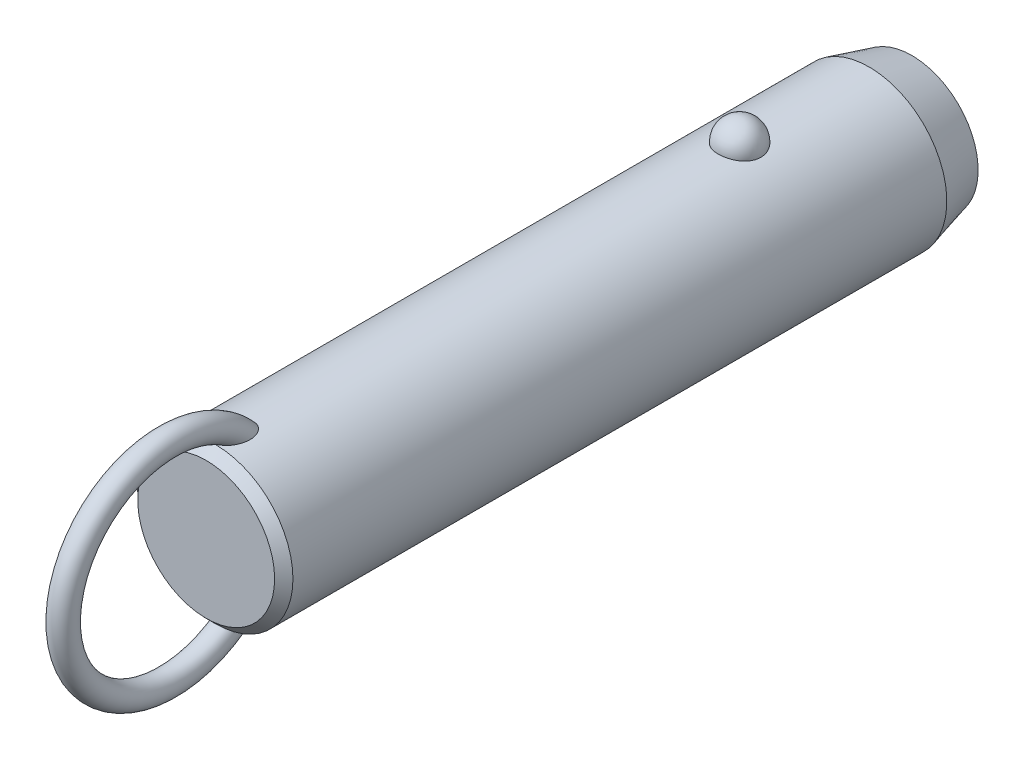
ISO-10303-21;
HEADER;
FILE_DESCRIPTION(('STEP AP214'),'2;1');
FILE_NAME('part.step','',(''),(''),'','','');
FILE_SCHEMA(('AUTOMOTIVE_DESIGN { 1 0 10303 214 1 1 1 1 }'));
ENDSEC;
DATA;
#1=APPLICATION_CONTEXT('core data for automotive mechanical design processes');
#2=APPLICATION_PROTOCOL_DEFINITION('international standard','automotive_design',2000,#1);
#3=PRODUCT_CONTEXT('',#1,'mechanical');
#4=PRODUCT('Part','Part','',(#3));
#5=PRODUCT_RELATED_PRODUCT_CATEGORY('part','',(#4));
#6=PRODUCT_DEFINITION_FORMATION('','',#4);
#7=PRODUCT_DEFINITION_CONTEXT('part definition',#1,'design');
#8=PRODUCT_DEFINITION('design','',#6,#7);
#9=PRODUCT_DEFINITION_SHAPE('','',#8);
#10=(LENGTH_UNIT() NAMED_UNIT(*) SI_UNIT(.MILLI.,.METRE.));
#11=(NAMED_UNIT(*) PLANE_ANGLE_UNIT() SI_UNIT($,.RADIAN.));
#12=(NAMED_UNIT(*) SI_UNIT($,.STERADIAN.) SOLID_ANGLE_UNIT());
#13=UNCERTAINTY_MEASURE_WITH_UNIT(LENGTH_MEASURE(1.E-05),#10,'distance_accuracy_value','');
#14=(GEOMETRIC_REPRESENTATION_CONTEXT(3) GLOBAL_UNCERTAINTY_ASSIGNED_CONTEXT((#13)) GLOBAL_UNIT_ASSIGNED_CONTEXT((#10,
#11,#12)) REPRESENTATION_CONTEXT('',''));
#15=CARTESIAN_POINT('',(0.,0.,0.));
#16=DIRECTION('',(0.,0.,1.));
#17=DIRECTION('',(1.,0.,0.));
#18=AXIS2_PLACEMENT_3D('',#15,#16,#17);
#19=CARTESIAN_POINT('',(0.,0.,71.1));
#20=DIRECTION('',(0.,0.,-1.));
#21=DIRECTION('',(-1.,0.,0.));
#22=AXIS2_PLACEMENT_3D('',#19,#20,#21);
#23=CYLINDRICAL_SURFACE('',#22,12.7);
#24=CARTESIAN_POINT('',(3.46661256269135,12.2177165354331,-3.5));
#25=CARTESIAN_POINT('',(3.4666090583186,12.2177194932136,-3.30432790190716));
#26=CARTESIAN_POINT('',(3.45063567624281,12.2222841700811,-3.10861112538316));
#27=CARTESIAN_POINT('',(3.38712451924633,12.2400345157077,-2.72271899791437));
#28=CARTESIAN_POINT('',(3.33957415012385,12.2532236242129,-2.53254588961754));
#29=CARTESIAN_POINT('',(3.2141234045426,12.286724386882,-2.16324948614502));
#30=CARTESIAN_POINT('',(3.13623639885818,12.3070329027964,-1.98412136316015));
#31=CARTESIAN_POINT('',(2.95205930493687,12.3525018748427,-1.64180592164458));
#32=CARTESIAN_POINT('',(2.84577003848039,12.3776621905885,-1.47861814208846));
#33=CARTESIAN_POINT('',(2.60688050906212,12.4301712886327,-1.17190583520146));
#34=CARTESIAN_POINT('',(2.47415697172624,12.4575299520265,-1.02847897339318));
#35=CARTESIAN_POINT('',(2.18615174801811,12.5112810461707,-0.766177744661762));
#36=CARTESIAN_POINT('',(2.03087002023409,12.5376734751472,-0.64730342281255));
#37=CARTESIAN_POINT('',(1.70237334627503,12.5864761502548,-0.437732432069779));
#38=CARTESIAN_POINT('',(1.52920948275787,12.6088972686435,-0.346958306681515));
#39=CARTESIAN_POINT('',(1.16944170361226,12.6473352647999,-0.195750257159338));
#40=CARTESIAN_POINT('',(0.982839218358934,12.663352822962,-0.135313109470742));
#41=CARTESIAN_POINT('',(0.604961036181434,12.6869706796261,-0.0473241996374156));
#42=CARTESIAN_POINT('',(0.41382314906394,12.6947125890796,-0.0192185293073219));
#43=CARTESIAN_POINT('',(0.0293827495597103,12.7014203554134,0.0051725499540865));
#44=CARTESIAN_POINT('',(-0.163919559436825,12.7003870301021,0.00146092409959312));
#45=CARTESIAN_POINT('',(-0.544374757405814,12.689735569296,-0.0373939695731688));
#46=CARTESIAN_POINT('',(-0.731575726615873,12.6802364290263,-0.0721015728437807));
#47=CARTESIAN_POINT('',(-1.09733277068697,12.6538333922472,-0.171364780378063));
#48=CARTESIAN_POINT('',(-1.27588869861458,12.6369293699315,-0.235920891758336));
#49=CARTESIAN_POINT('',(-1.6204698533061,12.5973946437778,-0.393548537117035));
#50=CARTESIAN_POINT('',(-1.78641865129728,12.5747321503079,-0.486778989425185));
#51=CARTESIAN_POINT('',(-2.10030671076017,12.5261316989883,-0.699110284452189));
#52=CARTESIAN_POINT('',(-2.24824419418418,12.5001934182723,-0.818213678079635));
#53=CARTESIAN_POINT('',(-2.52491489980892,12.4472906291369,-1.08157124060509));
#54=CARTESIAN_POINT('',(-2.65324222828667,12.4203160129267,-1.22624992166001));
#55=CARTESIAN_POINT('',(-2.88410007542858,12.3687509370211,-1.53528325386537));
#56=CARTESIAN_POINT('',(-2.98662883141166,12.3441606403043,-1.69963924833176));
#57=CARTESIAN_POINT('',(-3.16432417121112,12.2998199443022,-2.04548497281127));
#58=CARTESIAN_POINT('',(-3.23917525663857,12.2801261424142,-2.22714424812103));
#59=CARTESIAN_POINT('',(-3.35800573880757,12.248167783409,-2.6009138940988));
#60=CARTESIAN_POINT('',(-3.4019860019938,12.2359030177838,-2.79302397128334));
#61=CARTESIAN_POINT('',(-3.45784812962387,12.2202347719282,-3.18140279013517));
#62=CARTESIAN_POINT('',(-3.46986123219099,12.2167950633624,-3.37765118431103));
#63=CARTESIAN_POINT('',(-3.46186273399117,12.2190638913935,-3.76943689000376));
#64=CARTESIAN_POINT('',(-3.44185196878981,12.2247721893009,-3.96497421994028));
#65=CARTESIAN_POINT('',(-3.37048652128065,12.2446381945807,-4.34881728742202));
#66=CARTESIAN_POINT('',(-3.31928253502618,12.2587552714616,-4.53715319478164));
#67=CARTESIAN_POINT('',(-3.18693461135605,12.2938237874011,-4.90231727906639));
#68=CARTESIAN_POINT('',(-3.1057895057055,12.3147754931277,-5.07914500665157));
#69=CARTESIAN_POINT('',(-2.91506431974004,12.3613125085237,-5.41732059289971));
#70=CARTESIAN_POINT('',(-2.80533587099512,12.3869217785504,-5.57858147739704));
#71=CARTESIAN_POINT('',(-2.560414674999,12.4398525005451,-5.88013283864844));
#72=CARTESIAN_POINT('',(-2.42522099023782,12.4671740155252,-6.02042254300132));
#73=CARTESIAN_POINT('',(-2.1323357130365,12.5205965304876,-6.27662798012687));
#74=CARTESIAN_POINT('',(-1.97456596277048,12.5466928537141,-6.3924554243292));
#75=CARTESIAN_POINT('',(-1.64115839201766,12.5946384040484,-6.59583547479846));
#76=CARTESIAN_POINT('',(-1.46552179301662,12.6164879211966,-6.68339001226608));
#77=CARTESIAN_POINT('',(-1.10356050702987,12.6532533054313,-6.82682153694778));
#78=CARTESIAN_POINT('',(-0.9173913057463,12.6682500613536,-6.8830698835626));
#79=CARTESIAN_POINT('',(-0.537836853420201,12.6900288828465,-6.96386887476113));
#80=CARTESIAN_POINT('',(-0.344452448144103,12.6968119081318,-6.9884232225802));
#81=CARTESIAN_POINT('',(0.0402577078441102,12.7013667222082,-7.00496469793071));
#82=CARTESIAN_POINT('',(0.231556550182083,12.6993008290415,-6.99753844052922));
#83=CARTESIAN_POINT('',(0.610105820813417,12.6867505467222,-6.9516636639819));
#84=CARTESIAN_POINT('',(0.797356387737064,12.6762664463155,-6.913216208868));
#85=CARTESIAN_POINT('',(1.16186657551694,12.6480587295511,-6.80658431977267));
#86=CARTESIAN_POINT('',(1.33915951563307,12.6303611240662,-6.73850666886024));
#87=CARTESIAN_POINT('',(1.67968518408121,12.5896027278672,-6.5745087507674));
#88=CARTESIAN_POINT('',(1.84291705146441,12.5665416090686,-6.47858678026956));
#89=CARTESIAN_POINT('',(2.15340192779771,12.5171072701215,-6.25982455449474));
#90=CARTESIAN_POINT('',(2.30037831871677,12.4906895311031,-6.13660186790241));
#91=CARTESIAN_POINT('',(2.5717412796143,12.4376567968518,-5.86739587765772));
#92=CARTESIAN_POINT('',(2.69612388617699,12.4110417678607,-5.72140858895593));
#93=CARTESIAN_POINT('',(2.92107785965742,12.360051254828,-5.40794137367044));
#94=CARTESIAN_POINT('',(3.02121329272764,12.3357209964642,-5.24014110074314));
#95=CARTESIAN_POINT('',(3.19236291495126,12.2925446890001,-4.88969865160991));
#96=CARTESIAN_POINT('',(3.26338839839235,12.2736965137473,-4.70706226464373));
#97=CARTESIAN_POINT('',(3.36788038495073,12.245404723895,-4.35469510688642));
#98=CARTESIAN_POINT('',(3.40484026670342,12.2351018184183,-4.18605935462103));
#99=CARTESIAN_POINT('',(3.45420764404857,12.2212564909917,-3.84496058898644));
#100=CARTESIAN_POINT('',(3.46661565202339,12.2177139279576,-3.67249765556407));
#101=CARTESIAN_POINT('',(3.46661256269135,12.2177165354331,-3.5));
#102=B_SPLINE_CURVE_WITH_KNOTS('',3,(#24,#25,#26,#27,#28,#29,#30,#31,#32,#33,#34,#35,#36,#37,
#38,#39,#40,#41,#42,#43,#44,#45,#46,#47,#48,#49,#50,#51,#52,#53,#54,#55,#56,#57,#58,#59,#60,#61,
#62,#63,#64,#65,#66,#67,#68,#69,#70,#71,#72,#73,#74,#75,#76,#77,#78,#79,#80,#81,#82,#83,#84,#85,
#86,#87,#88,#89,#90,#91,#92,#93,#94,#95,#96,#97,#98,#99,#100,#101),.UNSPECIFIED.,.T.,.F.,(4,2,2,
2,2,2,2,2,2,2,2,2,2,2,2,2,2,2,2,2,2,2,2,2,2,2,2,2,2,2,2,2,2,2,2,2,2,2,4),(0.,0.586396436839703,
1.17302689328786,1.7593990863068,2.34575431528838,2.93491084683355,3.52406845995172,
4.11158733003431,4.69904375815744,5.2762784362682,5.85345931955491,6.42265312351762,
6.99185659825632,7.56427334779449,8.136746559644,8.71981013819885,9.3029135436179,
9.89247258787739,10.4820150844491,11.0691335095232,11.6562366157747,12.2405256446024,
12.8248374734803,13.412244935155,13.9996740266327,14.5891883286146,15.1786623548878,
15.7609861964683,16.3432419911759,16.9148635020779,17.4864654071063,18.0560241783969,
18.6256177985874,19.2037609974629,19.7820055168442,20.3699810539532,20.957728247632,
21.4746855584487,21.9916320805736),.UNSPECIFIED.);
#103=CARTESIAN_POINT('',(3.46661256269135,12.2177165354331,-3.5));
#104=VERTEX_POINT('',#103);
#105=EDGE_CURVE('E41',#104,#104,#102,.T.);
#106=ORIENTED_EDGE('',*,*,#105,.T.);
#107=EDGE_LOOP('',(#106));
#108=FACE_BOUND('',#107,.T.);
#109=CARTESIAN_POINT('',(0.,0.,82.3));
#110=DIRECTION('',(0.,0.,1.));
#111=DIRECTION('',(1.,0.,0.));
#112=AXIS2_PLACEMENT_3D('',#109,#110,#111);
#113=CIRCLE('',#112,12.7);
#114=CARTESIAN_POINT('',(12.7,0.,82.3));
#115=VERTEX_POINT('',#114);
#116=EDGE_CURVE('E10',#115,#115,#113,.F.);
#117=ORIENTED_EDGE('',*,*,#116,.T.);
#118=EDGE_LOOP('',(#117));
#119=FACE_BOUND('',#118,.T.);
#120=CARTESIAN_POINT('',(-0.548122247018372,-12.6881662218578,76.0432187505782));
#121=CARTESIAN_POINT('',(-0.648865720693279,-12.6838128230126,76.077926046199));
#122=CARTESIAN_POINT('',(-0.746398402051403,-12.6783867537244,76.1220428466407));
#123=CARTESIAN_POINT('',(-0.93212506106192,-12.666091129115,76.2267647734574));
#124=CARTESIAN_POINT('',(-1.02030388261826,-12.6592192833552,76.287396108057));
#125=CARTESIAN_POINT('',(-1.18487740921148,-12.6448747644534,76.421847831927));
#126=CARTESIAN_POINT('',(-1.26134296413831,-12.637406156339,76.4955825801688));
#127=CARTESIAN_POINT('',(-1.4023120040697,-12.6225412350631,76.6536045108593));
#128=CARTESIAN_POINT('',(-1.46681470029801,-12.6151449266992,76.7378923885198));
#129=CARTESIAN_POINT('',(-1.60714786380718,-12.5981718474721,76.9496577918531));
#130=CARTESIAN_POINT('',(-1.67725126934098,-12.588900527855,77.0809624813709));
#131=CARTESIAN_POINT('',(-1.79536591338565,-12.5725964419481,77.3532471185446));
#132=CARTESIAN_POINT('',(-1.84333535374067,-12.5655679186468,77.4942447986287));
#133=CARTESIAN_POINT('',(-1.93422576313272,-12.5519624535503,77.8376455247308));
#134=CARTESIAN_POINT('',(-1.96788773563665,-12.5466298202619,78.0425578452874));
#135=CARTESIAN_POINT('',(-1.9941399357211,-12.542463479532,78.3517600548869));
#136=CARTESIAN_POINT('',(-1.99883864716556,-12.5417153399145,78.4552987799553));
#137=CARTESIAN_POINT('',(-2.00078003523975,-12.5414074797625,78.6624512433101));
#138=CARTESIAN_POINT('',(-1.99802449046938,-12.5418474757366,78.7660649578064));
#139=CARTESIAN_POINT('',(-1.98336733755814,-12.5441750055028,79.0103207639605));
#140=CARTESIAN_POINT('',(-1.96851430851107,-12.5465291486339,79.1507804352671));
#141=CARTESIAN_POINT('',(-1.92707089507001,-12.5529612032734,79.4299607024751));
#142=CARTESIAN_POINT('',(-1.90047458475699,-12.5570399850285,79.5686803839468));
#143=CARTESIAN_POINT('',(-1.83619120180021,-12.5666008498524,79.8434113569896));
#144=CARTESIAN_POINT('',(-1.79850828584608,-12.57208240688,79.9794236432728));
#145=CARTESIAN_POINT('',(-1.71223796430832,-12.5841228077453,80.2478421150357));
#146=CARTESIAN_POINT('',(-1.66365679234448,-12.5906810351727,80.3802503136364));
#147=CARTESIAN_POINT('',(-1.5780450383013,-12.6016176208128,80.5854887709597));
#148=CARTESIAN_POINT('',(-1.54477252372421,-12.6057501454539,80.6599149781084));
#149=CARTESIAN_POINT('',(-1.47424480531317,-12.6141930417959,80.8068393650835));
#150=CARTESIAN_POINT('',(-1.43699041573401,-12.6185033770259,80.8793379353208));
#151=CARTESIAN_POINT('',(-1.35825795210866,-12.6272207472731,81.0218926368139));
#152=CARTESIAN_POINT('',(-1.31678520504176,-12.6316276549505,81.0919517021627));
#153=CARTESIAN_POINT('',(-1.22917793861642,-12.6404532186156,81.2290705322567));
#154=CARTESIAN_POINT('',(-1.18304514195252,-12.6448718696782,81.2961313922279));
#155=CARTESIAN_POINT('',(-1.07246411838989,-12.6547893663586,81.4438741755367));
#156=CARTESIAN_POINT('',(-1.00642239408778,-12.6602600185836,81.5233844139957));
#157=CARTESIAN_POINT('',(-0.864441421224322,-12.6707460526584,81.6731698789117));
#158=CARTESIAN_POINT('',(-0.788516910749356,-12.6757620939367,81.7434585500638));
#159=CARTESIAN_POINT('',(-0.652215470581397,-12.6833591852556,81.8486801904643));
#160=CARTESIAN_POINT('',(-0.594982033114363,-12.6861973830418,81.8876241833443));
#161=CARTESIAN_POINT('',(-0.475269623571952,-12.6912445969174,81.9564899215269));
#162=CARTESIAN_POINT('',(-0.412800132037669,-12.6934547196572,81.9864275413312));
#163=CARTESIAN_POINT('',(-0.295749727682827,-12.6966636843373,82.0297565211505));
#164=CARTESIAN_POINT('',(-0.241949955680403,-12.6978134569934,82.0452188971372));
#165=CARTESIAN_POINT('',(-0.132508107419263,-12.6994261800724,82.0668845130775));
#166=CARTESIAN_POINT('',(-0.0768679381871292,-12.6998898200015,82.0730970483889));
#167=CARTESIAN_POINT('',(0.0347696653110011,-12.7000752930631,82.0755838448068));
#168=CARTESIAN_POINT('',(0.0907676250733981,-12.6997954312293,82.0718353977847));
#169=CARTESIAN_POINT('',(0.201283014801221,-12.6985255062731,82.0547883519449));
#170=CARTESIAN_POINT('',(0.255799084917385,-12.6975348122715,82.0414812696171));
#171=CARTESIAN_POINT('',(0.376042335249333,-12.6946091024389,82.0020379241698));
#172=CARTESIAN_POINT('',(0.44095085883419,-12.6924943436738,81.9734492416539));
#173=CARTESIAN_POINT('',(0.565350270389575,-12.6875639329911,81.9063234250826));
#174=CARTESIAN_POINT('',(0.624828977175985,-12.6847467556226,81.8677646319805));
#175=CARTESIAN_POINT('',(0.774116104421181,-12.6767252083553,81.756949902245));
#176=CARTESIAN_POINT('',(0.859449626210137,-12.6711344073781,81.6787605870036));
#177=CARTESIAN_POINT('',(1.01789440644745,-12.6593922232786,81.510943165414));
#178=CARTESIAN_POINT('',(1.09096902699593,-12.653239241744,81.421282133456));
#179=CARTESIAN_POINT('',(1.22268793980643,-12.6411674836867,81.2402658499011));
#180=CARTESIAN_POINT('',(1.28193986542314,-12.6352572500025,81.149345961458));
#181=CARTESIAN_POINT('',(1.39259777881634,-12.6235401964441,80.9627929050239));
#182=CARTESIAN_POINT('',(1.44399707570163,-12.6177334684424,80.8671558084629));
#183=CARTESIAN_POINT('',(1.53972870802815,-12.6064093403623,80.6722738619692));
#184=CARTESIAN_POINT('',(1.58405262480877,-12.6008922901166,80.5730248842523));
#185=CARTESIAN_POINT('',(1.66600705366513,-12.5903187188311,80.3717727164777));
#186=CARTESIAN_POINT('',(1.70363651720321,-12.5852622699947,80.2697690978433));
#187=CARTESIAN_POINT('',(1.77545379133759,-12.5753406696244,80.0543580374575));
#188=CARTESIAN_POINT('',(1.80903453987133,-12.5705328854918,79.940745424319));
#189=CARTESIAN_POINT('',(1.86844163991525,-12.5618400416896,79.7114575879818));
#190=CARTESIAN_POINT('',(1.89426665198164,-12.5579551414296,79.5957820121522));
#191=CARTESIAN_POINT('',(1.9378546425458,-12.5513030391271,79.3630072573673));
#192=CARTESIAN_POINT('',(1.9556264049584,-12.5485346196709,79.2459097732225));
#193=CARTESIAN_POINT('',(1.98264463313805,-12.5442934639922,79.0107473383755));
#194=CARTESIAN_POINT('',(1.99189298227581,-12.5428204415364,78.8926826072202));
#195=CARTESIAN_POINT('',(2.00416068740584,-12.540871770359,78.5806225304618));
#196=CARTESIAN_POINT('',(1.99944433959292,-12.541631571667,78.3862290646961));
#197=CARTESIAN_POINT('',(1.96113755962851,-12.5476846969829,78.0003095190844));
#198=CARTESIAN_POINT('',(1.92758341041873,-12.5529723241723,77.8087801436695));
#199=CARTESIAN_POINT('',(1.83934342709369,-12.5661532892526,77.4822728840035));
#200=CARTESIAN_POINT('',(1.79215440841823,-12.5730485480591,77.3452499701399));
#201=CARTESIAN_POINT('',(1.67676242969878,-12.588958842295,77.0804459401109));
#202=CARTESIAN_POINT('',(1.60859050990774,-12.597970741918,76.9526515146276));
#203=CARTESIAN_POINT('',(1.46583832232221,-12.6152829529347,76.7358006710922));
#204=CARTESIAN_POINT('',(1.39525727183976,-12.6233659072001,76.6441050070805));
#205=CARTESIAN_POINT('',(1.23992594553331,-12.6395676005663,76.4734854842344));
#206=CARTESIAN_POINT('',(1.1551793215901,-12.6476863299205,76.3945583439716));
#207=CARTESIAN_POINT('',(0.971995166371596,-12.6630846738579,76.2526438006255));
#208=CARTESIAN_POINT('',(0.873456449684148,-12.6703572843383,76.1897849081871));
#209=CARTESIAN_POINT('',(0.665847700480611,-12.6829569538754,76.0844870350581));
#210=CARTESIAN_POINT('',(0.556784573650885,-12.688285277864,76.0420347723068));
#211=CARTESIAN_POINT('',(0.347338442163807,-12.6956226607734,75.9844434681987));
#212=CARTESIAN_POINT('',(0.247759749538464,-12.6979816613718,75.9663996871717));
#213=CARTESIAN_POINT('',(0.0470218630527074,-12.7003077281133,75.948600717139));
#214=CARTESIAN_POINT('',(-0.0541350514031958,-12.7002779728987,75.9488212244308));
#215=CARTESIAN_POINT('',(-0.221414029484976,-12.6982482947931,75.9643639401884));
#216=CARTESIAN_POINT('',(-0.288055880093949,-12.6969033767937,75.9746662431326));
#217=CARTESIAN_POINT('',(-0.419599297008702,-12.6932369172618,76.0031348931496));
#218=CARTESIAN_POINT('',(-0.484501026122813,-12.6909154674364,76.0213005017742));
#219=CARTESIAN_POINT('',(-0.548122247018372,-12.6881662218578,76.0432187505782));
#220=B_SPLINE_CURVE_WITH_KNOTS('',3,(#120,#121,#122,#123,#124,#125,#126,#127,#128,#129,#130,
#131,#132,#133,#134,#135,#136,#137,#138,#139,#140,#141,#142,#143,#144,#145,#146,#147,#148,#149,
#150,#151,#152,#153,#154,#155,#156,#157,#158,#159,#160,#161,#162,#163,#164,#165,#166,#167,#168,
#169,#170,#171,#172,#173,#174,#175,#176,#177,#178,#179,#180,#181,#182,#183,#184,#185,#186,#187,
#188,#189,#190,#191,#192,#193,#194,#195,#196,#197,#198,#199,#200,#201,#202,#203,#204,#205,#206,
#207,#208,#209,#210,#211,#212,#213,#214,#215,#216,#217,#218,#219),.UNSPECIFIED.,.T.,.F.,(4,2,2,
2,2,2,2,2,2,2,2,2,2,2,2,2,2,2,2,2,2,2,2,2,2,2,2,2,2,2,2,2,2,2,2,2,2,2,2,2,2,2,2,2,2,2,2,2,2,4),
(0.,0.31964225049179,0.639794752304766,0.957927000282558,1.27608021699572,1.72100165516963,
2.16675988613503,2.78630021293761,3.0970578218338,3.40774128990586,3.83096358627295,
4.2543996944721,4.67767724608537,5.10071330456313,5.34550297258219,5.59024267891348,
5.83467707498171,6.07902143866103,6.38891080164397,6.69834321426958,6.90560910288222,
7.11250749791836,7.27977315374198,7.44687060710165,7.61434932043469,7.78197685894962,
7.99365544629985,8.20579780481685,8.55147335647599,8.89816429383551,9.22375138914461,
9.5496143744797,9.87586224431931,10.202161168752,10.557587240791,10.9130746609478,
11.2681734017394,11.6231936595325,12.2046601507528,12.7853961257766,13.219164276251,
13.6522938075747,13.9989174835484,14.3454519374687,14.6946768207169,15.0436740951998,
15.3457513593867,15.6474266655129,15.8493051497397,16.0511646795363),.UNSPECIFIED.);
#221=CARTESIAN_POINT('',(-0.548122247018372,-12.6881662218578,76.0432187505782));
#222=VERTEX_POINT('',#221);
#223=EDGE_CURVE('E59',#222,#222,#220,.T.);
#224=ORIENTED_EDGE('',*,*,#223,.T.);
#225=EDGE_LOOP('',(#224));
#226=FACE_BOUND('',#225,.T.);
#227=CARTESIAN_POINT('',(-0.548122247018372,12.6881662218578,76.0432187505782));
#228=CARTESIAN_POINT('',(-0.459436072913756,12.6919968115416,76.012673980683));
#229=CARTESIAN_POINT('',(-0.368189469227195,12.6949996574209,75.9893913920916));
#230=CARTESIAN_POINT('',(-0.183024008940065,12.6990186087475,75.9584062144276));
#231=CARTESIAN_POINT('',(-0.0891049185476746,12.7000345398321,75.9507049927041));
#232=CARTESIAN_POINT('',(0.0987147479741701,12.6999636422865,75.9512455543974));
#233=CARTESIAN_POINT('',(0.192615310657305,12.6988761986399,75.9594920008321));
#234=CARTESIAN_POINT('',(0.377658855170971,12.6947211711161,75.9915515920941));
#235=CARTESIAN_POINT('',(0.468801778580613,12.6916535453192,76.0153650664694));
#236=CARTESIAN_POINT('',(0.645809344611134,12.6838788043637,76.0774565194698));
#237=CARTESIAN_POINT('',(0.731679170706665,12.6791733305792,76.115720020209));
#238=CARTESIAN_POINT('',(0.896315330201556,12.6686004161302,76.205120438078));
#239=CARTESIAN_POINT('',(0.975080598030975,12.6627328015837,76.2562592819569));
#240=CARTESIAN_POINT('',(1.12963655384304,12.6499161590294,76.3736782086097));
#241=CARTESIAN_POINT('',(1.20478673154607,12.6429194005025,76.4407929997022));
#242=CARTESIAN_POINT('',(1.34448241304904,12.6288282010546,76.5852250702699));
#243=CARTESIAN_POINT('',(1.40902173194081,12.621733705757,76.6625482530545));
#244=CARTESIAN_POINT('',(1.55208211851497,12.6050877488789,76.8592475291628));
#245=CARTESIAN_POINT('',(1.62510490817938,12.5957546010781,76.9826540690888));
#246=CARTESIAN_POINT('',(1.7501904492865,12.5789823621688,77.2397690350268));
#247=CARTESIAN_POINT('',(1.80221377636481,12.5715468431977,77.373496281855));
#248=CARTESIAN_POINT('',(1.90309965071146,12.5567434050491,77.6983516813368));
#249=CARTESIAN_POINT('',(1.94342317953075,12.5504515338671,77.8921611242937));
#250=CARTESIAN_POINT('',(1.99332997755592,12.5426147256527,78.2837881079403));
#251=CARTESIAN_POINT('',(2.00285305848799,12.5410790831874,78.4816127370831));
#252=CARTESIAN_POINT('',(1.99678999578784,12.5420407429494,78.8166427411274));
#253=CARTESIAN_POINT('',(1.98794117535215,12.5434564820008,78.9540428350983));
#254=CARTESIAN_POINT('',(1.95865119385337,12.5480641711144,79.2276394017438));
#255=CARTESIAN_POINT('',(1.9382043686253,12.5512569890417,79.3638352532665));
#256=CARTESIAN_POINT('',(1.88647896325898,12.5591352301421,79.6342493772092));
#257=CARTESIAN_POINT('',(1.85518800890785,12.5638223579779,79.7684652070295));
#258=CARTESIAN_POINT('',(1.78217886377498,12.5743868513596,80.0339362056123));
#259=CARTESIAN_POINT('',(1.74046509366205,12.5802637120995,80.1651926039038));
#260=CARTESIAN_POINT('',(1.66024095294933,12.5910571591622,80.3860855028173));
#261=CARTESIAN_POINT('',(1.62434772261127,12.5957535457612,80.4766904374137));
#262=CARTESIAN_POINT('',(1.5470900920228,12.6054762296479,80.6555125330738));
#263=CARTESIAN_POINT('',(1.50572681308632,12.6105024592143,80.7437301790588));
#264=CARTESIAN_POINT('',(1.41728020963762,12.620748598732,80.9169321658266));
#265=CARTESIAN_POINT('',(1.37021377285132,12.625967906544,81.0019251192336));
#266=CARTESIAN_POINT('',(1.2696962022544,12.6364721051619,81.1680072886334));
#267=CARTESIAN_POINT('',(1.21624929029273,12.6417569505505,81.2490990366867));
#268=CARTESIAN_POINT('',(1.10304413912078,12.6521331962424,81.4047027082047));
#269=CARTESIAN_POINT('',(1.04340936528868,12.657226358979,81.4793033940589));
#270=CARTESIAN_POINT('',(0.91591933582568,12.6670906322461,81.621324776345));
#271=CARTESIAN_POINT('',(0.84806456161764,12.6718617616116,81.6887458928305));
#272=CARTESIAN_POINT('',(0.717035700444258,12.67987711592,81.8006247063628));
#273=CARTESIAN_POINT('',(0.655526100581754,12.6832377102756,81.8469970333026));
#274=CARTESIAN_POINT('',(0.525985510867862,12.6892676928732,81.9296195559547));
#275=CARTESIAN_POINT('',(0.45796984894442,12.6919386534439,81.9658927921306));
#276=CARTESIAN_POINT('',(0.334859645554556,12.695691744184,82.0166572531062));
#277=CARTESIAN_POINT('',(0.281116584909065,12.6970073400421,82.0343733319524));
#278=CARTESIAN_POINT('',(0.171425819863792,12.6989609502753,82.0606429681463));
#279=CARTESIAN_POINT('',(0.11548082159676,12.699599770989,82.0692074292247));
#280=CARTESIAN_POINT('',(0.00272618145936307,12.7001251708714,82.0762531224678));
#281=CARTESIAN_POINT('',(-0.0540859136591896,12.7000089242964,82.0746964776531));
#282=CARTESIAN_POINT('',(-0.166544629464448,12.6990328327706,82.0616005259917));
#283=CARTESIAN_POINT('',(-0.222190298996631,12.6981724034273,82.0500533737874));
#284=CARTESIAN_POINT('',(-0.342018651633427,12.695562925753,82.0149128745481));
#285=CARTESIAN_POINT('',(-0.405606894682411,12.6936676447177,81.9893322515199));
#286=CARTESIAN_POINT('',(-0.527815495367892,12.6891754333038,81.9283111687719));
#287=CARTESIAN_POINT('',(-0.586425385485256,12.6865770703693,81.8928505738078));
#288=CARTESIAN_POINT('',(-0.731842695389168,12.6792129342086,81.7914960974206));
#289=CARTESIAN_POINT('',(-0.814709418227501,12.6740767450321,81.7200395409));
#290=CARTESIAN_POINT('',(-0.969101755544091,12.6632083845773,81.5658900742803));
#291=CARTESIAN_POINT('',(-1.04059564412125,12.6574746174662,81.4831668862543));
#292=CARTESIAN_POINT('',(-1.16981116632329,12.6461638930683,81.3158096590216));
#293=CARTESIAN_POINT('',(-1.22811369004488,12.6405994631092,81.2316166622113));
#294=CARTESIAN_POINT('',(-1.33743405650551,12.6295007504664,81.0585791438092));
#295=CARTESIAN_POINT('',(-1.38844577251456,12.6239664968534,80.9697307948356));
#296=CARTESIAN_POINT('',(-1.48400702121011,12.6130898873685,80.788389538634));
#297=CARTESIAN_POINT('',(-1.52854232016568,12.6077479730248,80.6958891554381));
#298=CARTESIAN_POINT('',(-1.6115011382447,12.5974127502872,80.5081607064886));
#299=CARTESIAN_POINT('',(-1.64992317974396,12.5924195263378,80.4129319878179));
#300=CARTESIAN_POINT('',(-1.73468589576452,12.581070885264,80.1828936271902));
#301=CARTESIAN_POINT('',(-1.77831261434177,12.5749388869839,80.0470661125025));
#302=CARTESIAN_POINT('',(-1.85439734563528,12.5639437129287,79.7722128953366));
#303=CARTESIAN_POINT('',(-1.88684994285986,12.5590811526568,79.6331856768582));
#304=CARTESIAN_POINT('',(-1.94008483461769,12.550968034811,79.3530923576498));
#305=CARTESIAN_POINT('',(-1.96088706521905,12.5477147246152,79.2120301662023));
#306=CARTESIAN_POINT('',(-1.99000539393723,12.5431291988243,78.9286689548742));
#307=CARTESIAN_POINT('',(-1.99832911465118,12.5417958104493,78.7863707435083));
#308=CARTESIAN_POINT('',(-2.00166624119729,12.5412674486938,78.4576271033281));
#309=CARTESIAN_POINT('',(-1.99178843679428,12.5428579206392,78.271088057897));
#310=CARTESIAN_POINT('',(-1.9445518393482,12.5502731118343,77.9016240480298));
#311=CARTESIAN_POINT('',(-1.90724032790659,12.5560905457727,77.7186934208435));
#312=CARTESIAN_POINT('',(-1.81330718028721,12.5699462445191,77.4048488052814));
#313=CARTESIAN_POINT('',(-1.76338820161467,12.5771273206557,77.2719105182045));
#314=CARTESIAN_POINT('',(-1.64305018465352,12.593414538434,77.0156813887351));
#315=CARTESIAN_POINT('',(-1.57265346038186,12.6025185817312,76.892380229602));
#316=CARTESIAN_POINT('',(-1.42634956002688,12.6198178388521,76.6835648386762));
#317=CARTESIAN_POINT('',(-1.35423772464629,12.6278405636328,76.5953846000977));
#318=CARTESIAN_POINT('',(-1.19645664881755,12.6437632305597,76.4321079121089));
#319=CARTESIAN_POINT('',(-1.11080536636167,12.6516633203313,76.3569944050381));
#320=CARTESIAN_POINT('',(-0.947219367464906,12.6648319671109,76.2378114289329));
#321=CARTESIAN_POINT('',(-0.871624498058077,12.670300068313,76.1905414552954));
#322=CARTESIAN_POINT('',(-0.714161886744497,12.6801492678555,76.1077413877));
#323=CARTESIAN_POINT('',(-0.632295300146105,12.684530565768,76.0722091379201));
#324=CARTESIAN_POINT('',(-0.548122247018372,12.6881662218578,76.0432187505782));
#325=B_SPLINE_CURVE_WITH_KNOTS('',3,(#227,#228,#229,#230,#231,#232,#233,#234,#235,#236,#237,
#238,#239,#240,#241,#242,#243,#244,#245,#246,#247,#248,#249,#250,#251,#252,#253,#254,#255,#256,
#257,#258,#259,#260,#261,#262,#263,#264,#265,#266,#267,#268,#269,#270,#271,#272,#273,#274,#275,
#276,#277,#278,#279,#280,#281,#282,#283,#284,#285,#286,#287,#288,#289,#290,#291,#292,#293,#294,
#295,#296,#297,#298,#299,#300,#301,#302,#303,#304,#305,#306,#307,#308,#309,#310,#311,#312,#313,
#314,#315,#316,#317,#318,#319,#320,#321,#322,#323,#324),.UNSPECIFIED.,.T.,.F.,(4,2,2,2,2,2,2,2,
2,2,2,2,2,2,2,2,2,2,2,2,2,2,2,2,2,2,2,2,2,2,2,2,2,2,2,2,2,2,2,2,2,2,2,2,2,2,2,2,4),(0.,
0.281328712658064,0.562682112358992,0.844117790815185,1.12555942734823,1.40671982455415,
1.68792232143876,1.98972294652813,2.29169886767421,2.72039860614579,3.14989948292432,
3.74084916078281,4.33295293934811,4.74554109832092,5.15833092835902,5.57159335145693,
5.98468079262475,6.2772277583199,6.56971484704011,6.86135609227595,7.15280542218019,
7.43927407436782,7.72572595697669,7.95635862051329,8.18646071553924,8.35559393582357,
8.52452541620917,8.69408946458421,8.86378678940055,9.06834348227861,9.27332014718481,
9.60010414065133,9.92778432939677,10.2350252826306,10.5425229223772,10.8506864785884,
11.1589244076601,11.5867893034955,12.0148612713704,12.4421984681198,12.8692745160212,
13.4279365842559,13.9856380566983,14.4107062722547,14.8353130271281,15.1765567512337,
15.5173516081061,15.7844129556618,16.051425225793),.UNSPECIFIED.);
#326=CARTESIAN_POINT('',(-0.548122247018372,12.6881662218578,76.0432187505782));
#327=VERTEX_POINT('',#326);
#328=EDGE_CURVE('E67',#327,#327,#325,.T.);
#329=ORIENTED_EDGE('',*,*,#328,.T.);
#330=EDGE_LOOP('',(#329));
#331=FACE_BOUND('',#330,.T.);
#332=CARTESIAN_POINT('',(0.,0.,-24.6999999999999));
#333=DIRECTION('',(0.,0.,-1.));
#334=DIRECTION('',(-1.,0.,0.));
#335=AXIS2_PLACEMENT_3D('',#332,#333,#334);
#336=CIRCLE('',#335,12.7);
#337=CARTESIAN_POINT('',(-12.7,0.,-24.6999999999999));
#338=VERTEX_POINT('',#337);
#339=EDGE_CURVE('E56',#338,#338,#336,.F.);
#340=ORIENTED_EDGE('',*,*,#339,.T.);
#341=EDGE_LOOP('',(#340));
#342=FACE_BOUND('',#341,.T.);
#343=ADVANCED_FACE('F37',(#108,#119,#226,#331,#342),#23,.T.);
#344=CARTESIAN_POINT('',(0.,0.,-31.7));
#345=DIRECTION('',(0.,0.,-1.));
#346=DIRECTION('',(-1.,0.,0.));
#347=AXIS2_PLACEMENT_3D('',#344,#345,#346);
#348=PLANE('',#347);
#349=CARTESIAN_POINT('',(0.,0.,-31.7));
#350=DIRECTION('',(0.,0.,-1.));
#351=DIRECTION('',(-1.,0.,0.));
#352=AXIS2_PLACEMENT_3D('',#349,#350,#351);
#353=CIRCLE('',#352,10.8243556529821);
#354=CARTESIAN_POINT('',(-10.8243556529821,0.,-31.7));
#355=VERTEX_POINT('',#354);
#356=EDGE_CURVE('E66',#355,#355,#353,.T.);
#357=ORIENTED_EDGE('',*,*,#356,.T.);
#358=EDGE_LOOP('',(#357));
#359=FACE_BOUND('',#358,.T.);
#360=ADVANCED_FACE('F85',(#359),#348,.T.);
#361=CARTESIAN_POINT('',(0.,0.,-31.7));
#362=DIRECTION('',(0.,0.,1.));
#363=DIRECTION('',(1.,0.,0.));
#364=AXIS2_PLACEMENT_3D('',#361,#362,#363);
#365=CONICAL_SURFACE('',#364,10.8243556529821,0.261799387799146);
#366=ORIENTED_EDGE('',*,*,#339,.F.);
#367=EDGE_LOOP('',(#366));
#368=FACE_BOUND('',#367,.T.);
#369=ORIENTED_EDGE('',*,*,#356,.F.);
#370=EDGE_LOOP('',(#369));
#371=FACE_BOUND('',#370,.T.);
#372=ADVANCED_FACE('F83',(#368,#371),#365,.T.);
#373=CARTESIAN_POINT('',(0.,0.,83.8));
#374=DIRECTION('',(0.,0.,1.));
#375=DIRECTION('',(1.,0.,0.));
#376=AXIS2_PLACEMENT_3D('',#373,#374,#375);
#377=PLANE('',#376);
#378=CARTESIAN_POINT('',(0.,0.,83.8));
#379=DIRECTION('',(0.,0.,1.));
#380=DIRECTION('',(1.,0.,0.));
#381=AXIS2_PLACEMENT_3D('',#378,#379,#380);
#382=CIRCLE('',#381,11.2);
#383=CARTESIAN_POINT('',(11.2,0.,83.8));
#384=VERTEX_POINT('',#383);
#385=EDGE_CURVE('E50',#384,#384,#382,.T.);
#386=ORIENTED_EDGE('',*,*,#385,.T.);
#387=EDGE_LOOP('',(#386));
#388=FACE_BOUND('',#387,.T.);
#389=ADVANCED_FACE('F77',(#388),#377,.T.);
#390=CARTESIAN_POINT('',(0.,0.,90.15));
#391=DIRECTION('',(1.,0.,0.));
#392=DIRECTION('',(0.,0.,-1.));
#393=AXIS2_PLACEMENT_3D('',#390,#391,#392);
#394=TOROIDAL_SURFACE('',#393,17.05,2.);
#395=ORIENTED_EDGE('',*,*,#328,.F.);
#396=EDGE_LOOP('',(#395));
#397=FACE_BOUND('',#396,.T.);
#398=ORIENTED_EDGE('',*,*,#223,.F.);
#399=EDGE_LOOP('',(#398));
#400=FACE_BOUND('',#399,.T.);
#401=ADVANCED_FACE('F73',(#397,#400),#394,.T.);
#402=CARTESIAN_POINT('',(0.,0.,83.8));
#403=DIRECTION('',(0.,0.,-1.));
#404=DIRECTION('',(-1.,0.,0.));
#405=AXIS2_PLACEMENT_3D('',#402,#403,#404);
#406=CONICAL_SURFACE('',#405,11.2,0.785398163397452);
#407=ORIENTED_EDGE('',*,*,#116,.F.);
#408=EDGE_LOOP('',(#407));
#409=FACE_BOUND('',#408,.T.);
#410=ORIENTED_EDGE('',*,*,#385,.F.);
#411=EDGE_LOOP('',(#410));
#412=FACE_BOUND('',#411,.T.);
#413=ADVANCED_FACE('F39',(#409,#412),#406,.T.);
#414=CARTESIAN_POINT('',(0.,12.7,-3.5));
#415=DIRECTION('',(0.,1.,0.));
#416=DIRECTION('',(0.,0.,-1.));
#417=AXIS2_PLACEMENT_3D('',#414,#415,#416);
#418=SPHERICAL_SURFACE('',#417,3.5);
#419=ORIENTED_EDGE('',*,*,#105,.F.);
#420=EDGE_LOOP('',(#419));
#421=FACE_BOUND('',#420,.T.);
#422=ADVANCED_FACE('F79',(#421),#418,.T.);
#423=CLOSED_SHELL('',(#343,#360,#372,#389,#401,#413,#422));
#424=MANIFOLD_SOLID_BREP('B2',#423);
#425=ADVANCED_BREP_SHAPE_REPRESENTATION('',(#18,#424),#14);
#426=SHAPE_DEFINITION_REPRESENTATION(#9,#425);
ENDSEC;
END-ISO-10303-21;
